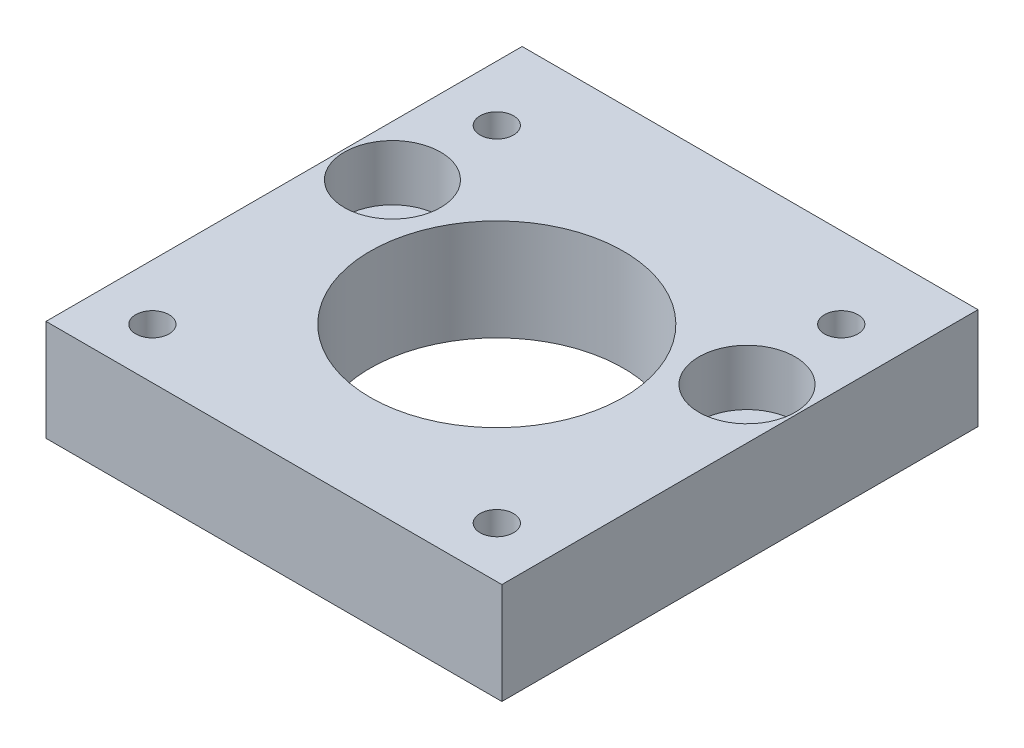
from build123d import *

# Parameters (mm, degrees)
SKETCH_1_W          = 45
SKETCH_1_H          = 10
EXTRUDE_1_DEPTH     = 47
SKETCH_2_R          = 12.5
SKETCH_2_R_2        = 1.65
SKETCH_2_R_3        = 2.75
CUT_EXTRUDE_2_DEPTH = 47
SKETCH_3_R          = 4.75
CUT_EXTRUDE_3_DEPTH = 5.5


with BuildPart() as part:
    # Sketch 1 → Extrude 1 (new body)
    with BuildSketch(Plane.XY):
        with Locations((22.5, 5)):
            Rectangle(SKETCH_1_W, SKETCH_1_H)
    extrude(amount=EXTRUDE_1_DEPTH)

    # Sketch 2 → Cut-Extrude 2 (cut)
    with BuildSketch(Plane(origin=(0, 10, 0), x_dir=(1, 0, 0), z_dir=(0, 1, 0))):
        with Locations(Location((22.5, -25, 0), (0, 0, 270))):
            Circle(SKETCH_2_R)
        with Locations(Location((5.5, -8, 0), (0, 0, 270))):
            Circle(SKETCH_2_R_2)
        with Locations(Location((39.5, -8, 0), (0, 0, 270))):
            Circle(SKETCH_2_R_2)
        with Locations(Location((39.5, -42, 0), (0, 0, 270))):
            Circle(SKETCH_2_R_2)
        with Locations(Location((5.5, -42, 0), (0, 0, 270))):
            Circle(SKETCH_2_R_2)
        with Locations(Location((40, -17.8, 0), (0, 0, 270))):
            Circle(SKETCH_2_R_3)
        with Locations(Location((5, -17.8, 0), (0, 0, 270))):
            Circle(SKETCH_2_R_3)
    extrude(amount=-CUT_EXTRUDE_2_DEPTH, mode=Mode.SUBTRACT)

    # Sketch 3 → Cut-Extrude 3 (cut)
    with BuildSketch(Plane(origin=(0, 10, 0), x_dir=(1, 0, 0), z_dir=(0, 1, 0))):
        with Locations(Location((40, -17.8, 0), (0, 0, 270))):
            Circle(SKETCH_3_R)
        with Locations(Location((5, -17.8, 0), (0, 0, 270))):
            Circle(SKETCH_3_R)
    extrude(amount=-CUT_EXTRUDE_3_DEPTH, mode=Mode.SUBTRACT)


solid = part.part
